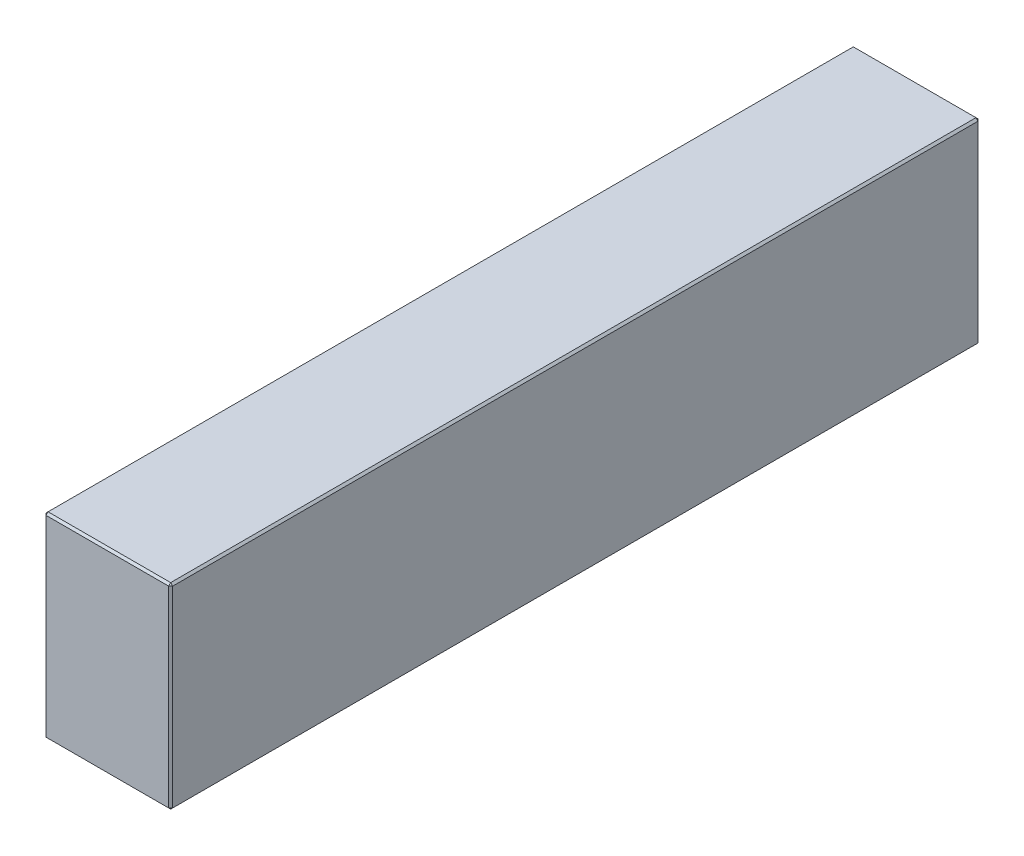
ISO-10303-21;
HEADER;
FILE_DESCRIPTION(('STEP AP214'),'2;1');
FILE_NAME('part.step','',(''),(''),'','','');
FILE_SCHEMA(('AUTOMOTIVE_DESIGN { 1 0 10303 214 1 1 1 1 }'));
ENDSEC;
DATA;
#1=APPLICATION_CONTEXT('core data for automotive mechanical design processes');
#2=APPLICATION_PROTOCOL_DEFINITION('international standard','automotive_design',2000,#1);
#3=PRODUCT_CONTEXT('',#1,'mechanical');
#4=PRODUCT('Part','Part','',(#3));
#5=PRODUCT_RELATED_PRODUCT_CATEGORY('part','',(#4));
#6=PRODUCT_DEFINITION_FORMATION('','',#4);
#7=PRODUCT_DEFINITION_CONTEXT('part definition',#1,'design');
#8=PRODUCT_DEFINITION('design','',#6,#7);
#9=PRODUCT_DEFINITION_SHAPE('','',#8);
#10=(LENGTH_UNIT() NAMED_UNIT(*) SI_UNIT(.MILLI.,.METRE.));
#11=(NAMED_UNIT(*) PLANE_ANGLE_UNIT() SI_UNIT($,.RADIAN.));
#12=(NAMED_UNIT(*) SI_UNIT($,.STERADIAN.) SOLID_ANGLE_UNIT());
#13=UNCERTAINTY_MEASURE_WITH_UNIT(LENGTH_MEASURE(1.E-05),#10,'distance_accuracy_value','');
#14=(GEOMETRIC_REPRESENTATION_CONTEXT(3) GLOBAL_UNCERTAINTY_ASSIGNED_CONTEXT((#13)) GLOBAL_UNIT_ASSIGNED_CONTEXT((#10,
#11,#12)) REPRESENTATION_CONTEXT('',''));
#15=CARTESIAN_POINT('',(0.,0.,0.));
#16=DIRECTION('',(0.,0.,1.));
#17=DIRECTION('',(1.,0.,0.));
#18=AXIS2_PLACEMENT_3D('',#15,#16,#17);
#19=CARTESIAN_POINT('',(-31.,96.,198.));
#20=DIRECTION('',(1.,0.,0.));
#21=DIRECTION('',(0.,0.,-1.));
#22=AXIS2_PLACEMENT_3D('',#19,#20,#21);
#23=PLANE('',#22);
#24=DIRECTION('',(0.,-1.,0.));
#25=VECTOR('',#24,1.);
#26=CARTESIAN_POINT('',(-31.,96.,-197.));
#27=LINE('',#26,#25);
#28=CARTESIAN_POINT('',(-31.,95.,-197.));
#29=VERTEX_POINT('',#28);
#30=CARTESIAN_POINT('',(-31.,1.00000000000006,-197.));
#31=VERTEX_POINT('',#30);
#32=EDGE_CURVE('E114',#29,#31,#27,.T.);
#33=ORIENTED_EDGE('',*,*,#32,.T.);
#34=DIRECTION('',(0.,0.,1.));
#35=VECTOR('',#34,1.);
#36=CARTESIAN_POINT('',(-31.,1.00000000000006,198.));
#37=LINE('',#36,#35);
#38=CARTESIAN_POINT('',(-31.,1.00000000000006,197.));
#39=VERTEX_POINT('',#38);
#40=EDGE_CURVE('E110',#31,#39,#37,.T.);
#41=ORIENTED_EDGE('',*,*,#40,.T.);
#42=DIRECTION('',(0.,1.,0.));
#43=VECTOR('',#42,1.);
#44=CARTESIAN_POINT('',(-31.,96.,197.));
#45=LINE('',#44,#43);
#46=CARTESIAN_POINT('',(-31.,95.,197.));
#47=VERTEX_POINT('',#46);
#48=EDGE_CURVE('E103',#39,#47,#45,.T.);
#49=ORIENTED_EDGE('',*,*,#48,.T.);
#50=DIRECTION('',(0.,0.,-1.));
#51=VECTOR('',#50,1.);
#52=CARTESIAN_POINT('',(-31.,95.,-198.));
#53=LINE('',#52,#51);
#54=EDGE_CURVE('E107',#47,#29,#53,.T.);
#55=ORIENTED_EDGE('',*,*,#54,.T.);
#56=EDGE_LOOP('',(#33,#41,#49,#55));
#57=FACE_BOUND('',#56,.T.);
#58=ADVANCED_FACE('F15',(#57),#23,.F.);
#59=CARTESIAN_POINT('',(31.,96.,198.));
#60=DIRECTION('',(0.,0.,-1.));
#61=DIRECTION('',(-1.,0.,0.));
#62=AXIS2_PLACEMENT_3D('',#59,#60,#61);
#63=PLANE('',#62);
#64=DIRECTION('',(-1.,0.,0.));
#65=VECTOR('',#64,1.);
#66=CARTESIAN_POINT('',(-31.,95.,198.));
#67=LINE('',#66,#65);
#68=CARTESIAN_POINT('',(30.,95.,198.));
#69=VERTEX_POINT('',#68);
#70=CARTESIAN_POINT('',(-30.,95.,198.));
#71=VERTEX_POINT('',#70);
#72=EDGE_CURVE('E164',#69,#71,#67,.T.);
#73=ORIENTED_EDGE('',*,*,#72,.T.);
#74=DIRECTION('',(0.,-1.,0.));
#75=VECTOR('',#74,1.);
#76=CARTESIAN_POINT('',(-30.,96.,198.));
#77=LINE('',#76,#75);
#78=CARTESIAN_POINT('',(-30.,1.00000000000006,198.));
#79=VERTEX_POINT('',#78);
#80=EDGE_CURVE('E122',#71,#79,#77,.T.);
#81=ORIENTED_EDGE('',*,*,#80,.T.);
#82=DIRECTION('',(1.,0.,0.));
#83=VECTOR('',#82,1.);
#84=CARTESIAN_POINT('',(31.,1.00000000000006,198.));
#85=LINE('',#84,#83);
#86=CARTESIAN_POINT('',(30.,1.00000000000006,198.));
#87=VERTEX_POINT('',#86);
#88=EDGE_CURVE('E168',#79,#87,#85,.T.);
#89=ORIENTED_EDGE('',*,*,#88,.T.);
#90=DIRECTION('',(0.,1.,0.));
#91=VECTOR('',#90,1.);
#92=CARTESIAN_POINT('',(30.,96.,198.));
#93=LINE('',#92,#91);
#94=EDGE_CURVE('E166',#87,#69,#93,.T.);
#95=ORIENTED_EDGE('',*,*,#94,.T.);
#96=EDGE_LOOP('',(#73,#81,#89,#95));
#97=FACE_BOUND('',#96,.T.);
#98=ADVANCED_FACE('F275',(#97),#63,.F.);
#99=CARTESIAN_POINT('',(31.,96.,198.));
#100=DIRECTION('',(-1.,0.,0.));
#101=DIRECTION('',(0.,0.,1.));
#102=AXIS2_PLACEMENT_3D('',#99,#100,#101);
#103=PLANE('',#102);
#104=DIRECTION('',(0.,0.,-1.));
#105=VECTOR('',#104,1.);
#106=CARTESIAN_POINT('',(31.,1.00000000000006,198.));
#107=LINE('',#106,#105);
#108=CARTESIAN_POINT('',(31.,1.00000000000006,197.));
#109=VERTEX_POINT('',#108);
#110=CARTESIAN_POINT('',(31.,1.00000000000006,-197.));
#111=VERTEX_POINT('',#110);
#112=EDGE_CURVE('E159',#109,#111,#107,.T.);
#113=ORIENTED_EDGE('',*,*,#112,.T.);
#114=DIRECTION('',(0.,1.,0.));
#115=VECTOR('',#114,1.);
#116=CARTESIAN_POINT('',(31.,96.,-197.));
#117=LINE('',#116,#115);
#118=CARTESIAN_POINT('',(31.,95.,-197.));
#119=VERTEX_POINT('',#118);
#120=EDGE_CURVE('E161',#111,#119,#117,.T.);
#121=ORIENTED_EDGE('',*,*,#120,.T.);
#122=DIRECTION('',(0.,0.,1.));
#123=VECTOR('',#122,1.);
#124=CARTESIAN_POINT('',(31.,95.,198.));
#125=LINE('',#124,#123);
#126=CARTESIAN_POINT('',(31.,95.,197.));
#127=VERTEX_POINT('',#126);
#128=EDGE_CURVE('E155',#119,#127,#125,.T.);
#129=ORIENTED_EDGE('',*,*,#128,.T.);
#130=DIRECTION('',(0.,-1.,0.));
#131=VECTOR('',#130,1.);
#132=CARTESIAN_POINT('',(31.,96.,197.));
#133=LINE('',#132,#131);
#134=EDGE_CURVE('E157',#127,#109,#133,.T.);
#135=ORIENTED_EDGE('',*,*,#134,.T.);
#136=EDGE_LOOP('',(#113,#121,#129,#135));
#137=FACE_BOUND('',#136,.T.);
#138=ADVANCED_FACE('F254',(#137),#103,.F.);
#139=CARTESIAN_POINT('',(31.,96.,-198.));
#140=DIRECTION('',(0.,0.,1.));
#141=DIRECTION('',(1.,0.,0.));
#142=AXIS2_PLACEMENT_3D('',#139,#140,#141);
#143=PLANE('',#142);
#144=DIRECTION('',(0.,-1.,0.));
#145=VECTOR('',#144,1.);
#146=CARTESIAN_POINT('',(30.,96.,-198.));
#147=LINE('',#146,#145);
#148=CARTESIAN_POINT('',(30.,95.,-198.));
#149=VERTEX_POINT('',#148);
#150=CARTESIAN_POINT('',(30.,1.00000000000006,-198.));
#151=VERTEX_POINT('',#150);
#152=EDGE_CURVE('E148',#149,#151,#147,.T.);
#153=ORIENTED_EDGE('',*,*,#152,.T.);
#154=DIRECTION('',(-1.,0.,0.));
#155=VECTOR('',#154,1.);
#156=CARTESIAN_POINT('',(31.,1.00000000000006,-198.));
#157=LINE('',#156,#155);
#158=CARTESIAN_POINT('',(-30.,1.00000000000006,-198.));
#159=VERTEX_POINT('',#158);
#160=EDGE_CURVE('E153',#151,#159,#157,.T.);
#161=ORIENTED_EDGE('',*,*,#160,.T.);
#162=DIRECTION('',(0.,1.,0.));
#163=VECTOR('',#162,1.);
#164=CARTESIAN_POINT('',(-30.,96.,-198.));
#165=LINE('',#164,#163);
#166=CARTESIAN_POINT('',(-30.,95.,-198.));
#167=VERTEX_POINT('',#166);
#168=EDGE_CURVE('E150',#159,#167,#165,.T.);
#169=ORIENTED_EDGE('',*,*,#168,.T.);
#170=DIRECTION('',(1.,0.,0.));
#171=VECTOR('',#170,1.);
#172=CARTESIAN_POINT('',(31.,95.,-198.));
#173=LINE('',#172,#171);
#174=EDGE_CURVE('E146',#167,#149,#173,.T.);
#175=ORIENTED_EDGE('',*,*,#174,.T.);
#176=EDGE_LOOP('',(#153,#161,#169,#175));
#177=FACE_BOUND('',#176,.T.);
#178=ADVANCED_FACE('F284',(#177),#143,.F.);
#179=CARTESIAN_POINT('',(0.,96.,0.));
#180=DIRECTION('',(0.,1.,0.));
#181=DIRECTION('',(0.,0.,1.));
#182=AXIS2_PLACEMENT_3D('',#179,#180,#181);
#183=PLANE('',#182);
#184=DIRECTION('',(0.,0.,-1.));
#185=VECTOR('',#184,1.);
#186=CARTESIAN_POINT('',(30.,96.,-198.));
#187=LINE('',#186,#185);
#188=CARTESIAN_POINT('',(30.,96.,197.));
#189=VERTEX_POINT('',#188);
#190=CARTESIAN_POINT('',(30.,96.,-197.));
#191=VERTEX_POINT('',#190);
#192=EDGE_CURVE('E24',#189,#191,#187,.T.);
#193=ORIENTED_EDGE('',*,*,#192,.T.);
#194=DIRECTION('',(-1.,0.,0.));
#195=VECTOR('',#194,1.);
#196=CARTESIAN_POINT('',(-31.,96.,-197.));
#197=LINE('',#196,#195);
#198=CARTESIAN_POINT('',(-30.,96.,-197.));
#199=VERTEX_POINT('',#198);
#200=EDGE_CURVE('E9',#191,#199,#197,.T.);
#201=ORIENTED_EDGE('',*,*,#200,.T.);
#202=DIRECTION('',(0.,0.,1.));
#203=VECTOR('',#202,1.);
#204=CARTESIAN_POINT('',(-30.,96.,198.));
#205=LINE('',#204,#203);
#206=CARTESIAN_POINT('',(-30.,96.,197.));
#207=VERTEX_POINT('',#206);
#208=EDGE_CURVE('E180',#199,#207,#205,.T.);
#209=ORIENTED_EDGE('',*,*,#208,.T.);
#210=DIRECTION('',(1.,0.,0.));
#211=VECTOR('',#210,1.);
#212=CARTESIAN_POINT('',(31.,96.,197.));
#213=LINE('',#212,#211);
#214=EDGE_CURVE('E35',#207,#189,#213,.T.);
#215=ORIENTED_EDGE('',*,*,#214,.T.);
#216=EDGE_LOOP('',(#193,#201,#209,#215));
#217=FACE_BOUND('',#216,.T.);
#218=ADVANCED_FACE('F350',(#217),#183,.T.);
#219=CARTESIAN_POINT('',(0.,0.,0.));
#220=DIRECTION('',(0.,1.,0.));
#221=DIRECTION('',(0.,0.,1.));
#222=AXIS2_PLACEMENT_3D('',#219,#220,#221);
#223=PLANE('',#222);
#224=DIRECTION('',(0.,0.,1.));
#225=VECTOR('',#224,1.);
#226=CARTESIAN_POINT('',(30.,0.,0.));
#227=LINE('',#226,#225);
#228=CARTESIAN_POINT('',(30.,0.,-197.));
#229=VERTEX_POINT('',#228);
#230=CARTESIAN_POINT('',(30.,0.,197.));
#231=VERTEX_POINT('',#230);
#232=EDGE_CURVE('E171',#229,#231,#227,.T.);
#233=ORIENTED_EDGE('',*,*,#232,.T.);
#234=DIRECTION('',(-1.,0.,0.));
#235=VECTOR('',#234,1.);
#236=CARTESIAN_POINT('',(0.,0.,197.));
#237=LINE('',#236,#235);
#238=CARTESIAN_POINT('',(-30.,0.,197.));
#239=VERTEX_POINT('',#238);
#240=EDGE_CURVE('E177',#231,#239,#237,.T.);
#241=ORIENTED_EDGE('',*,*,#240,.T.);
#242=DIRECTION('',(0.,0.,-1.));
#243=VECTOR('',#242,1.);
#244=CARTESIAN_POINT('',(-30.,0.,0.));
#245=LINE('',#244,#243);
#246=CARTESIAN_POINT('',(-30.,0.,-197.));
#247=VERTEX_POINT('',#246);
#248=EDGE_CURVE('E175',#239,#247,#245,.T.);
#249=ORIENTED_EDGE('',*,*,#248,.T.);
#250=DIRECTION('',(1.,0.,0.));
#251=VECTOR('',#250,1.);
#252=CARTESIAN_POINT('',(0.,0.,-197.));
#253=LINE('',#252,#251);
#254=EDGE_CURVE('E173',#247,#229,#253,.T.);
#255=ORIENTED_EDGE('',*,*,#254,.T.);
#256=EDGE_LOOP('',(#233,#241,#249,#255));
#257=FACE_BOUND('',#256,.T.);
#258=ADVANCED_FACE('F246',(#257),#223,.F.);
#259=CARTESIAN_POINT('',(31.,96.,197.));
#260=DIRECTION('',(-0.707106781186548,0.,-0.707106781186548));
#261=DIRECTION('',(0.,-1.,0.));
#262=AXIS2_PLACEMENT_3D('',#259,#260,#261);
#263=PLANE('',#262);
#264=DIRECTION('',(-0.707106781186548,0.,0.707106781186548));
#265=VECTOR('',#264,1.);
#266=CARTESIAN_POINT('',(30.,95.,198.));
#267=LINE('',#266,#265);
#268=EDGE_CURVE('E19',#69,#127,#267,.F.);
#269=ORIENTED_EDGE('',*,*,#268,.F.);
#270=ORIENTED_EDGE('',*,*,#94,.F.);
#271=DIRECTION('',(0.707106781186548,0.,-0.707106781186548));
#272=VECTOR('',#271,1.);
#273=CARTESIAN_POINT('',(30.,1.00000000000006,198.));
#274=LINE('',#273,#272);
#275=EDGE_CURVE('E142',#109,#87,#274,.F.);
#276=ORIENTED_EDGE('',*,*,#275,.F.);
#277=ORIENTED_EDGE('',*,*,#134,.F.);
#278=EDGE_LOOP('',(#269,#270,#276,#277));
#279=FACE_BOUND('',#278,.T.);
#280=ADVANCED_FACE('F17',(#279),#263,.F.);
#281=CARTESIAN_POINT('',(30.,95.,198.));
#282=DIRECTION('',(0.577350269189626,0.577350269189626,0.577350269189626));
#283=DIRECTION('',(0.707106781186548,0.,-0.707106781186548));
#284=AXIS2_PLACEMENT_3D('',#281,#282,#283);
#285=PLANE('',#284);
#286=DIRECTION('',(0.,-0.707106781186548,0.707106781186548));
#287=VECTOR('',#286,1.);
#288=CARTESIAN_POINT('',(30.,95.,198.));
#289=LINE('',#288,#287);
#290=EDGE_CURVE('E226',#69,#189,#289,.F.);
#291=ORIENTED_EDGE('',*,*,#290,.F.);
#292=ORIENTED_EDGE('',*,*,#268,.T.);
#293=DIRECTION('',(-0.707106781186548,0.707106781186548,0.));
#294=VECTOR('',#293,1.);
#295=CARTESIAN_POINT('',(30.5,95.5,197.));
#296=LINE('',#295,#294);
#297=EDGE_CURVE('E228',#189,#127,#296,.F.);
#298=ORIENTED_EDGE('',*,*,#297,.F.);
#299=EDGE_LOOP('',(#291,#292,#298));
#300=FACE_BOUND('',#299,.T.);
#301=ADVANCED_FACE('F270',(#300),#285,.T.);
#302=CARTESIAN_POINT('',(30.,1.00000000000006,198.));
#303=DIRECTION('',(0.577350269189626,-0.577350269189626,0.577350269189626));
#304=DIRECTION('',(0.707106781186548,0.,-0.707106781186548));
#305=AXIS2_PLACEMENT_3D('',#302,#303,#304);
#306=PLANE('',#305);
#307=DIRECTION('',(-0.707106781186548,-0.707106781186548,0.));
#308=VECTOR('',#307,1.);
#309=CARTESIAN_POINT('',(30.5,0.500000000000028,197.));
#310=LINE('',#309,#308);
#311=EDGE_CURVE('E220',#109,#231,#310,.T.);
#312=ORIENTED_EDGE('',*,*,#311,.F.);
#313=ORIENTED_EDGE('',*,*,#275,.T.);
#314=DIRECTION('',(0.,0.707106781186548,0.707106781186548));
#315=VECTOR('',#314,1.);
#316=CARTESIAN_POINT('',(30.,1.00000000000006,198.));
#317=LINE('',#316,#315);
#318=EDGE_CURVE('E223',#231,#87,#317,.T.);
#319=ORIENTED_EDGE('',*,*,#318,.F.);
#320=EDGE_LOOP('',(#312,#313,#319));
#321=FACE_BOUND('',#320,.T.);
#322=ADVANCED_FACE('F235',(#321),#306,.T.);
#323=CARTESIAN_POINT('',(30.,96.,0.));
#324=DIRECTION('',(0.707106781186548,0.707106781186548,0.));
#325=DIRECTION('',(0.,0.,1.));
#326=AXIS2_PLACEMENT_3D('',#323,#324,#325);
#327=PLANE('',#326);
#328=ORIENTED_EDGE('',*,*,#297,.T.);
#329=ORIENTED_EDGE('',*,*,#128,.F.);
#330=DIRECTION('',(0.707106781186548,-0.707106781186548,0.));
#331=VECTOR('',#330,1.);
#332=CARTESIAN_POINT('',(31.,95.,-197.));
#333=LINE('',#332,#331);
#334=EDGE_CURVE('E215',#191,#119,#333,.T.);
#335=ORIENTED_EDGE('',*,*,#334,.F.);
#336=ORIENTED_EDGE('',*,*,#192,.F.);
#337=EDGE_LOOP('',(#328,#329,#335,#336));
#338=FACE_BOUND('',#337,.T.);
#339=ADVANCED_FACE('F265',(#338),#327,.T.);
#340=CARTESIAN_POINT('',(0.,96.,197.));
#341=DIRECTION('',(0.,0.707106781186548,0.707106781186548));
#342=DIRECTION('',(-1.,0.,0.));
#343=AXIS2_PLACEMENT_3D('',#340,#341,#342);
#344=PLANE('',#343);
#345=ORIENTED_EDGE('',*,*,#290,.T.);
#346=ORIENTED_EDGE('',*,*,#214,.F.);
#347=DIRECTION('',(0.,0.707106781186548,-0.707106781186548));
#348=VECTOR('',#347,1.);
#349=CARTESIAN_POINT('',(-30.,95.5,197.5));
#350=LINE('',#349,#348);
#351=EDGE_CURVE('E126',#71,#207,#350,.T.);
#352=ORIENTED_EDGE('',*,*,#351,.F.);
#353=ORIENTED_EDGE('',*,*,#72,.F.);
#354=EDGE_LOOP('',(#345,#346,#352,#353));
#355=FACE_BOUND('',#354,.T.);
#356=ADVANCED_FACE('F273',(#355),#344,.T.);
#357=CARTESIAN_POINT('',(-30.,96.,198.));
#358=DIRECTION('',(0.707106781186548,0.,-0.707106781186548));
#359=DIRECTION('',(0.,-1.,0.));
#360=AXIS2_PLACEMENT_3D('',#357,#358,#359);
#361=PLANE('',#360);
#362=DIRECTION('',(0.707106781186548,0.,0.707106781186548));
#363=VECTOR('',#362,1.);
#364=CARTESIAN_POINT('',(-30.,1.00000000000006,198.));
#365=LINE('',#364,#363);
#366=EDGE_CURVE('E127',#79,#39,#365,.F.);
#367=ORIENTED_EDGE('',*,*,#366,.F.);
#368=ORIENTED_EDGE('',*,*,#80,.F.);
#369=DIRECTION('',(-0.707106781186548,0.,-0.707106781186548));
#370=VECTOR('',#369,1.);
#371=CARTESIAN_POINT('',(-31.,95.,197.));
#372=LINE('',#371,#370);
#373=EDGE_CURVE('E118',#47,#71,#372,.F.);
#374=ORIENTED_EDGE('',*,*,#373,.F.);
#375=ORIENTED_EDGE('',*,*,#48,.F.);
#376=EDGE_LOOP('',(#367,#368,#374,#375));
#377=FACE_BOUND('',#376,.T.);
#378=ADVANCED_FACE('F120',(#377),#361,.F.);
#379=CARTESIAN_POINT('',(31.,1.00000000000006,198.));
#380=DIRECTION('',(0.,0.707106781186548,-0.707106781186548));
#381=DIRECTION('',(1.,0.,0.));
#382=AXIS2_PLACEMENT_3D('',#379,#380,#381);
#383=PLANE('',#382);
#384=ORIENTED_EDGE('',*,*,#318,.T.);
#385=ORIENTED_EDGE('',*,*,#88,.F.);
#386=DIRECTION('',(0.,-0.707106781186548,-0.707106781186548));
#387=VECTOR('',#386,1.);
#388=CARTESIAN_POINT('',(-30.,1.00000000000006,198.));
#389=LINE('',#388,#387);
#390=EDGE_CURVE('E211',#239,#79,#389,.F.);
#391=ORIENTED_EDGE('',*,*,#390,.F.);
#392=ORIENTED_EDGE('',*,*,#240,.F.);
#393=EDGE_LOOP('',(#384,#385,#391,#392));
#394=FACE_BOUND('',#393,.T.);
#395=ADVANCED_FACE('F243',(#394),#383,.F.);
#396=CARTESIAN_POINT('',(31.,1.00000000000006,198.));
#397=DIRECTION('',(-0.707106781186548,0.707106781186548,0.));
#398=DIRECTION('',(0.,0.,-1.));
#399=AXIS2_PLACEMENT_3D('',#396,#397,#398);
#400=PLANE('',#399);
#401=ORIENTED_EDGE('',*,*,#311,.T.);
#402=ORIENTED_EDGE('',*,*,#232,.F.);
#403=DIRECTION('',(0.707106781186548,0.707106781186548,0.));
#404=VECTOR('',#403,1.);
#405=CARTESIAN_POINT('',(30.5,0.500000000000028,-197.));
#406=LINE('',#405,#404);
#407=EDGE_CURVE('E208',#111,#229,#406,.F.);
#408=ORIENTED_EDGE('',*,*,#407,.F.);
#409=ORIENTED_EDGE('',*,*,#112,.F.);
#410=EDGE_LOOP('',(#401,#402,#408,#409));
#411=FACE_BOUND('',#410,.T.);
#412=ADVANCED_FACE('F251',(#411),#400,.F.);
#413=CARTESIAN_POINT('',(30.,96.,-198.));
#414=DIRECTION('',(-0.707106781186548,0.,0.707106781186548));
#415=DIRECTION('',(0.,-1.,0.));
#416=AXIS2_PLACEMENT_3D('',#413,#414,#415);
#417=PLANE('',#416);
#418=DIRECTION('',(0.707106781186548,0.,0.707106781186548));
#419=VECTOR('',#418,1.);
#420=CARTESIAN_POINT('',(31.,95.,-197.));
#421=LINE('',#420,#419);
#422=EDGE_CURVE('E217',#119,#149,#421,.F.);
#423=ORIENTED_EDGE('',*,*,#422,.F.);
#424=ORIENTED_EDGE('',*,*,#120,.F.);
#425=DIRECTION('',(-0.707106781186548,0.,-0.707106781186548));
#426=VECTOR('',#425,1.);
#427=CARTESIAN_POINT('',(30.,1.00000000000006,-198.));
#428=LINE('',#427,#426);
#429=EDGE_CURVE('E205',#151,#111,#428,.F.);
#430=ORIENTED_EDGE('',*,*,#429,.F.);
#431=ORIENTED_EDGE('',*,*,#152,.F.);
#432=EDGE_LOOP('',(#423,#424,#430,#431));
#433=FACE_BOUND('',#432,.T.);
#434=ADVANCED_FACE('F258',(#433),#417,.F.);
#435=CARTESIAN_POINT('',(31.,95.,-197.));
#436=DIRECTION('',(0.577350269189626,0.577350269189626,-0.577350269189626));
#437=DIRECTION('',(-0.707106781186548,0.,-0.707106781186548));
#438=AXIS2_PLACEMENT_3D('',#435,#436,#437);
#439=PLANE('',#438);
#440=ORIENTED_EDGE('',*,*,#334,.T.);
#441=ORIENTED_EDGE('',*,*,#422,.T.);
#442=DIRECTION('',(0.,0.707106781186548,0.707106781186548));
#443=VECTOR('',#442,1.);
#444=CARTESIAN_POINT('',(30.,95.5,-197.5));
#445=LINE('',#444,#443);
#446=EDGE_CURVE('E134',#191,#149,#445,.F.);
#447=ORIENTED_EDGE('',*,*,#446,.F.);
#448=EDGE_LOOP('',(#440,#441,#447));
#449=FACE_BOUND('',#448,.T.);
#450=ADVANCED_FACE('F325',(#449),#439,.T.);
#451=CARTESIAN_POINT('',(-31.,95.,197.));
#452=DIRECTION('',(-0.577350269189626,0.577350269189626,0.577350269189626));
#453=DIRECTION('',(0.707106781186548,0.,0.707106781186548));
#454=AXIS2_PLACEMENT_3D('',#451,#452,#453);
#455=PLANE('',#454);
#456=ORIENTED_EDGE('',*,*,#373,.T.);
#457=ORIENTED_EDGE('',*,*,#351,.T.);
#458=DIRECTION('',(-0.707106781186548,-0.707106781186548,0.));
#459=VECTOR('',#458,1.);
#460=CARTESIAN_POINT('',(-31.,95.,197.));
#461=LINE('',#460,#459);
#462=EDGE_CURVE('E130',#47,#207,#461,.F.);
#463=ORIENTED_EDGE('',*,*,#462,.F.);
#464=EDGE_LOOP('',(#456,#457,#463));
#465=FACE_BOUND('',#464,.T.);
#466=ADVANCED_FACE('F131',(#465),#455,.T.);
#467=CARTESIAN_POINT('',(-30.,1.00000000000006,198.));
#468=DIRECTION('',(-0.577350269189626,-0.577350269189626,0.577350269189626));
#469=DIRECTION('',(0.707106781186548,0.,0.707106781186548));
#470=AXIS2_PLACEMENT_3D('',#467,#468,#469);
#471=PLANE('',#470);
#472=ORIENTED_EDGE('',*,*,#390,.T.);
#473=ORIENTED_EDGE('',*,*,#366,.T.);
#474=DIRECTION('',(-0.707106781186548,0.707106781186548,0.));
#475=VECTOR('',#474,1.);
#476=CARTESIAN_POINT('',(-30.5,0.500000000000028,197.));
#477=LINE('',#476,#475);
#478=EDGE_CURVE('E135',#239,#39,#477,.T.);
#479=ORIENTED_EDGE('',*,*,#478,.F.);
#480=EDGE_LOOP('',(#472,#473,#479));
#481=FACE_BOUND('',#480,.T.);
#482=ADVANCED_FACE('F318',(#481),#471,.T.);
#483=CARTESIAN_POINT('',(30.,1.00000000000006,-198.));
#484=DIRECTION('',(0.577350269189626,-0.577350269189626,-0.577350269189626));
#485=DIRECTION('',(-0.707106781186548,0.,-0.707106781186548));
#486=AXIS2_PLACEMENT_3D('',#483,#484,#485);
#487=PLANE('',#486);
#488=ORIENTED_EDGE('',*,*,#429,.T.);
#489=ORIENTED_EDGE('',*,*,#407,.T.);
#490=DIRECTION('',(0.,-0.707106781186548,0.707106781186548));
#491=VECTOR('',#490,1.);
#492=CARTESIAN_POINT('',(30.,1.00000000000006,-198.));
#493=LINE('',#492,#491);
#494=EDGE_CURVE('E198',#151,#229,#493,.T.);
#495=ORIENTED_EDGE('',*,*,#494,.F.);
#496=EDGE_LOOP('',(#488,#489,#495));
#497=FACE_BOUND('',#496,.T.);
#498=ADVANCED_FACE('F314',(#497),#487,.T.);
#499=CARTESIAN_POINT('',(0.,96.,-197.));
#500=DIRECTION('',(0.,0.707106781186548,-0.707106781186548));
#501=DIRECTION('',(1.,0.,0.));
#502=AXIS2_PLACEMENT_3D('',#499,#500,#501);
#503=PLANE('',#502);
#504=ORIENTED_EDGE('',*,*,#446,.T.);
#505=ORIENTED_EDGE('',*,*,#174,.F.);
#506=DIRECTION('',(0.,-0.707106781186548,-0.707106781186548));
#507=VECTOR('',#506,1.);
#508=CARTESIAN_POINT('',(-30.,95.,-198.));
#509=LINE('',#508,#507);
#510=EDGE_CURVE('E195',#199,#167,#509,.T.);
#511=ORIENTED_EDGE('',*,*,#510,.F.);
#512=ORIENTED_EDGE('',*,*,#200,.F.);
#513=EDGE_LOOP('',(#504,#505,#511,#512));
#514=FACE_BOUND('',#513,.T.);
#515=ADVANCED_FACE('F311',(#514),#503,.T.);
#516=CARTESIAN_POINT('',(-30.,96.,0.));
#517=DIRECTION('',(-0.707106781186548,0.707106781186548,0.));
#518=DIRECTION('',(0.,0.,-1.));
#519=AXIS2_PLACEMENT_3D('',#516,#517,#518);
#520=PLANE('',#519);
#521=ORIENTED_EDGE('',*,*,#462,.T.);
#522=ORIENTED_EDGE('',*,*,#208,.F.);
#523=DIRECTION('',(0.707106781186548,0.707106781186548,0.));
#524=VECTOR('',#523,1.);
#525=CARTESIAN_POINT('',(-30.5,95.5,-197.));
#526=LINE('',#525,#524);
#527=EDGE_CURVE('E138',#29,#199,#526,.T.);
#528=ORIENTED_EDGE('',*,*,#527,.F.);
#529=ORIENTED_EDGE('',*,*,#54,.F.);
#530=EDGE_LOOP('',(#521,#522,#528,#529));
#531=FACE_BOUND('',#530,.T.);
#532=ADVANCED_FACE('F137',(#531),#520,.T.);
#533=CARTESIAN_POINT('',(-31.,1.00000000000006,198.));
#534=DIRECTION('',(0.707106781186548,0.707106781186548,0.));
#535=DIRECTION('',(0.,0.,1.));
#536=AXIS2_PLACEMENT_3D('',#533,#534,#535);
#537=PLANE('',#536);
#538=ORIENTED_EDGE('',*,*,#478,.T.);
#539=ORIENTED_EDGE('',*,*,#40,.F.);
#540=DIRECTION('',(0.707106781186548,-0.707106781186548,0.));
#541=VECTOR('',#540,1.);
#542=CARTESIAN_POINT('',(-31.,1.00000000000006,-197.));
#543=LINE('',#542,#541);
#544=EDGE_CURVE('E191',#247,#31,#543,.F.);
#545=ORIENTED_EDGE('',*,*,#544,.F.);
#546=ORIENTED_EDGE('',*,*,#248,.F.);
#547=EDGE_LOOP('',(#538,#539,#545,#546));
#548=FACE_BOUND('',#547,.T.);
#549=ADVANCED_FACE('F304',(#548),#537,.F.);
#550=CARTESIAN_POINT('',(31.,1.00000000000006,-198.));
#551=DIRECTION('',(0.,0.707106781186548,0.707106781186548));
#552=DIRECTION('',(-1.,0.,0.));
#553=AXIS2_PLACEMENT_3D('',#550,#551,#552);
#554=PLANE('',#553);
#555=ORIENTED_EDGE('',*,*,#494,.T.);
#556=ORIENTED_EDGE('',*,*,#254,.F.);
#557=DIRECTION('',(0.,0.707106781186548,-0.707106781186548));
#558=VECTOR('',#557,1.);
#559=CARTESIAN_POINT('',(-30.,0.500000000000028,-197.5));
#560=LINE('',#559,#558);
#561=EDGE_CURVE('E188',#159,#247,#560,.F.);
#562=ORIENTED_EDGE('',*,*,#561,.F.);
#563=ORIENTED_EDGE('',*,*,#160,.F.);
#564=EDGE_LOOP('',(#555,#556,#562,#563));
#565=FACE_BOUND('',#564,.T.);
#566=ADVANCED_FACE('F300',(#565),#554,.F.);
#567=CARTESIAN_POINT('',(-30.,95.,-198.));
#568=DIRECTION('',(-0.577350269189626,0.577350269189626,-0.577350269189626));
#569=DIRECTION('',(-0.707106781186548,0.,0.707106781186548));
#570=AXIS2_PLACEMENT_3D('',#567,#568,#569);
#571=PLANE('',#570);
#572=ORIENTED_EDGE('',*,*,#527,.T.);
#573=ORIENTED_EDGE('',*,*,#510,.T.);
#574=DIRECTION('',(0.707106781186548,0.,-0.707106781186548));
#575=VECTOR('',#574,1.);
#576=CARTESIAN_POINT('',(-30.,95.,-198.));
#577=LINE('',#576,#575);
#578=EDGE_CURVE('E186',#29,#167,#577,.T.);
#579=ORIENTED_EDGE('',*,*,#578,.F.);
#580=EDGE_LOOP('',(#572,#573,#579));
#581=FACE_BOUND('',#580,.T.);
#582=ADVANCED_FACE('F296',(#581),#571,.T.);
#583=CARTESIAN_POINT('',(-31.,1.00000000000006,-197.));
#584=DIRECTION('',(-0.577350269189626,-0.577350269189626,-0.577350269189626));
#585=DIRECTION('',(-0.707106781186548,0.,0.707106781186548));
#586=AXIS2_PLACEMENT_3D('',#583,#584,#585);
#587=PLANE('',#586);
#588=ORIENTED_EDGE('',*,*,#561,.T.);
#589=ORIENTED_EDGE('',*,*,#544,.T.);
#590=DIRECTION('',(-0.707106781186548,0.,0.707106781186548));
#591=VECTOR('',#590,1.);
#592=CARTESIAN_POINT('',(-31.,1.00000000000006,-197.));
#593=LINE('',#592,#591);
#594=EDGE_CURVE('E184',#159,#31,#593,.T.);
#595=ORIENTED_EDGE('',*,*,#594,.F.);
#596=EDGE_LOOP('',(#588,#589,#595));
#597=FACE_BOUND('',#596,.T.);
#598=ADVANCED_FACE('F292',(#597),#587,.T.);
#599=CARTESIAN_POINT('',(-31.,96.,-197.));
#600=DIRECTION('',(0.707106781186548,0.,0.707106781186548));
#601=DIRECTION('',(0.,-1.,0.));
#602=AXIS2_PLACEMENT_3D('',#599,#600,#601);
#603=PLANE('',#602);
#604=ORIENTED_EDGE('',*,*,#578,.T.);
#605=ORIENTED_EDGE('',*,*,#168,.F.);
#606=ORIENTED_EDGE('',*,*,#594,.T.);
#607=ORIENTED_EDGE('',*,*,#32,.F.);
#608=EDGE_LOOP('',(#604,#605,#606,#607));
#609=FACE_BOUND('',#608,.T.);
#610=ADVANCED_FACE('F289',(#609),#603,.F.);
#611=CLOSED_SHELL('',(#58,#98,#138,#178,#218,#258,#280,#301,#322,#339,#356,#378,#395,#412,#434,
#450,#466,#482,#498,#515,#532,#549,#566,#582,#598,#610));
#612=MANIFOLD_SOLID_BREP('B1',#611);
#613=ADVANCED_BREP_SHAPE_REPRESENTATION('',(#18,#612),#14);
#614=SHAPE_DEFINITION_REPRESENTATION(#9,#613);
ENDSEC;
END-ISO-10303-21;
